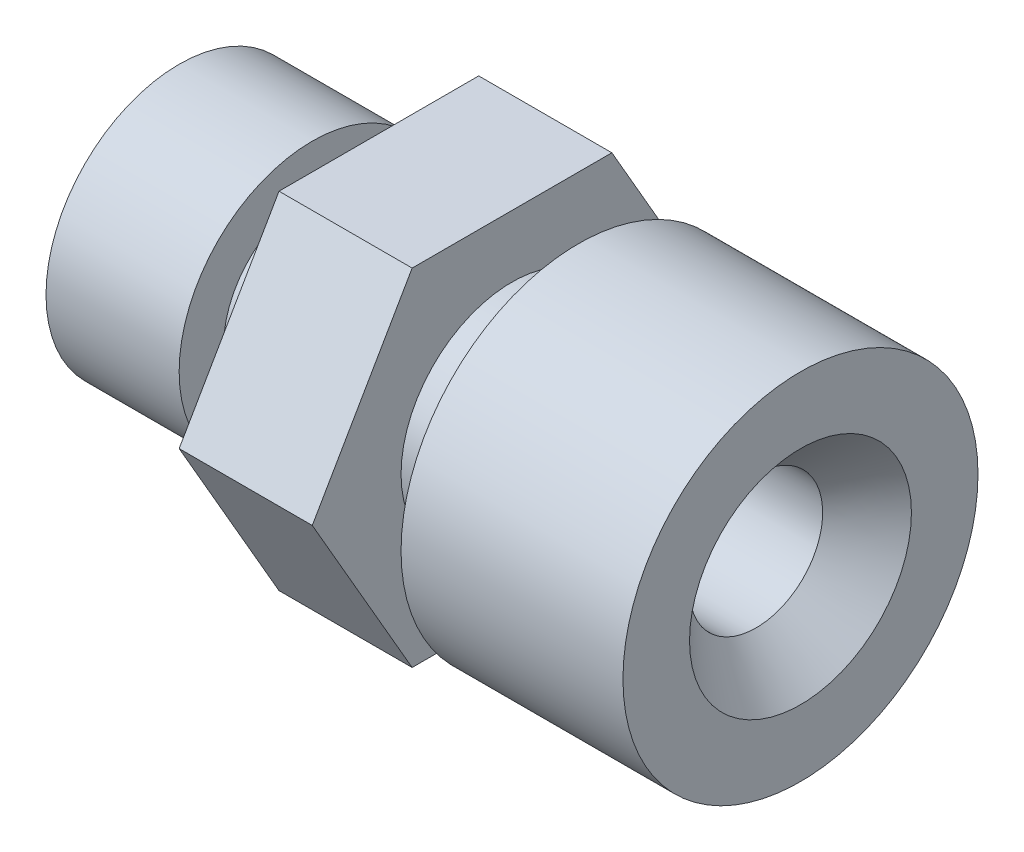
from build123d import *

# Parameters (mm, degrees)
SKETCH_2_R          = 11.419702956
CUT_EXTRUDE_2_DEPTH = 6
CHAMFER_1_SIZE      = 2


with BuildPart() as part:
    # Sketch 1 → Revolve 1 (revolve)
    with BuildSketch(Plane.XY, mode=Mode.PRIVATE) as revolve_1_sk:
        Polygon((0, 3), (0, 6), (6, 6), (6, 4), (9, 4), (9, 9), (15, 9), (15, 5), (18, 5), (18, 8), (28, 8), (28, 3), align=None)
    revolve(revolve_1_sk.sketch.rotate(Axis((0, 0, 0), (1, 0, 0)), 90), axis=Axis((0, 0, 0), (1, 0, 0)))

    # Sketch 2 → Cut-Extrude 2 (cut)
    with BuildSketch(Plane(origin=(15, 0, 0), x_dir=(0, 0, -1), z_dir=(1, 0, 0))):
        Circle(SKETCH_2_R)
        Polygon((4.5, 7.794228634), (-4.5, 7.794228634), (-9, 0), (-4.5, -7.794228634), (4.5, -7.794228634), (9, 0), align=None, mode=Mode.SUBTRACT)
    extrude(amount=-CUT_EXTRUDE_2_DEPTH, mode=Mode.SUBTRACT)

    # Chamfer 1
    chamfer_1_edges = [part.edges().sort_by_distance(p)[0] for p in [
        (28, 0, -3),
    ]]
    chamfer(chamfer_1_edges, length=CHAMFER_1_SIZE)


solid = part.part
